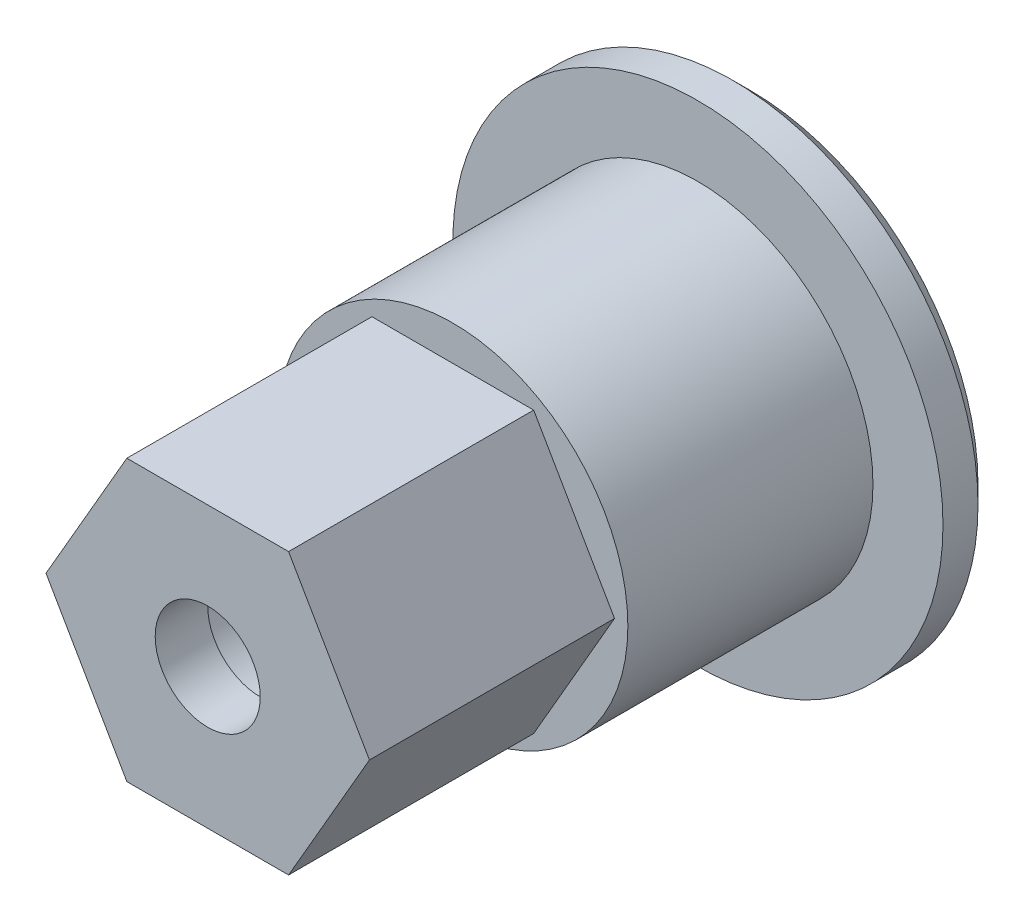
ISO-10303-21;
HEADER;
FILE_DESCRIPTION(('STEP AP214'),'2;1');
FILE_NAME('part.step','',(''),(''),'','','');
FILE_SCHEMA(('AUTOMOTIVE_DESIGN { 1 0 10303 214 1 1 1 1 }'));
ENDSEC;
DATA;
#1=APPLICATION_CONTEXT('core data for automotive mechanical design processes');
#2=APPLICATION_PROTOCOL_DEFINITION('international standard','automotive_design',2000,#1);
#3=PRODUCT_CONTEXT('',#1,'mechanical');
#4=PRODUCT('Part','Part','',(#3));
#5=PRODUCT_RELATED_PRODUCT_CATEGORY('part','',(#4));
#6=PRODUCT_DEFINITION_FORMATION('','',#4);
#7=PRODUCT_DEFINITION_CONTEXT('part definition',#1,'design');
#8=PRODUCT_DEFINITION('design','',#6,#7);
#9=PRODUCT_DEFINITION_SHAPE('','',#8);
#10=(LENGTH_UNIT() NAMED_UNIT(*) SI_UNIT(.MILLI.,.METRE.));
#11=(NAMED_UNIT(*) PLANE_ANGLE_UNIT() SI_UNIT($,.RADIAN.));
#12=(NAMED_UNIT(*) SI_UNIT($,.STERADIAN.) SOLID_ANGLE_UNIT());
#13=UNCERTAINTY_MEASURE_WITH_UNIT(LENGTH_MEASURE(1.E-05),#10,'distance_accuracy_value','');
#14=(GEOMETRIC_REPRESENTATION_CONTEXT(3) GLOBAL_UNCERTAINTY_ASSIGNED_CONTEXT((#13)) GLOBAL_UNIT_ASSIGNED_CONTEXT((#10,
#11,#12)) REPRESENTATION_CONTEXT('',''));
#15=CARTESIAN_POINT('',(0.,0.,0.));
#16=DIRECTION('',(0.,0.,1.));
#17=DIRECTION('',(1.,0.,0.));
#18=AXIS2_PLACEMENT_3D('',#15,#16,#17);
#19=CARTESIAN_POINT('',(0.,0.,31.));
#20=DIRECTION('',(0.,0.,-1.));
#21=DIRECTION('',(-1.,0.,0.));
#22=AXIS2_PLACEMENT_3D('',#19,#20,#21);
#23=CYLINDRICAL_SURFACE('',#22,3.);
#24=CARTESIAN_POINT('',(0.,0.,31.));
#25=DIRECTION('',(0.,0.,1.));
#26=DIRECTION('',(1.,0.,0.));
#27=AXIS2_PLACEMENT_3D('',#24,#25,#26);
#28=CIRCLE('',#27,3.);
#29=CARTESIAN_POINT('',(3.,0.,31.));
#30=VERTEX_POINT('',#29);
#31=EDGE_CURVE('E144',#30,#30,#28,.T.);
#32=ORIENTED_EDGE('',*,*,#31,.T.);
#33=EDGE_LOOP('',(#32));
#34=FACE_BOUND('',#33,.T.);
#35=CARTESIAN_POINT('',(0.,0.,28.));
#36=DIRECTION('',(0.,0.,-1.));
#37=DIRECTION('',(-1.,0.,0.));
#38=AXIS2_PLACEMENT_3D('',#35,#36,#37);
#39=CIRCLE('',#38,3.);
#40=CARTESIAN_POINT('',(-3.00000000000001,0.,28.));
#41=VERTEX_POINT('',#40);
#42=EDGE_CURVE('E152',#41,#41,#39,.T.);
#43=ORIENTED_EDGE('',*,*,#42,.T.);
#44=EDGE_LOOP('',(#43));
#45=FACE_BOUND('',#44,.T.);
#46=ADVANCED_FACE('F34',(#34,#45),#23,.F.);
#47=CARTESIAN_POINT('',(0.,0.,31.));
#48=DIRECTION('',(0.,0.,1.));
#49=DIRECTION('',(1.,0.,0.));
#50=AXIS2_PLACEMENT_3D('',#47,#48,#49);
#51=PLANE('',#50);
#52=ORIENTED_EDGE('',*,*,#31,.F.);
#53=EDGE_LOOP('',(#52));
#54=FACE_BOUND('',#53,.T.);
#55=DIRECTION('',(1.,0.,0.));
#56=VECTOR('',#55,1.);
#57=CARTESIAN_POINT('',(-4.61880215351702,-7.99999999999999,31.));
#58=LINE('',#57,#56);
#59=CARTESIAN_POINT('',(-4.61880215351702,-7.99999999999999,31.));
#60=VERTEX_POINT('',#59);
#61=CARTESIAN_POINT('',(4.61880215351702,-7.99999999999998,31.));
#62=VERTEX_POINT('',#61);
#63=EDGE_CURVE('E114',#60,#62,#58,.T.);
#64=ORIENTED_EDGE('',*,*,#63,.T.);
#65=DIRECTION('',(0.499999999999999,0.86602540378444,0.));
#66=VECTOR('',#65,1.);
#67=CARTESIAN_POINT('',(4.61880215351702,-7.99999999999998,31.));
#68=LINE('',#67,#66);
#69=CARTESIAN_POINT('',(9.23760430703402,0.,31.));
#70=VERTEX_POINT('',#69);
#71=EDGE_CURVE('E109',#62,#70,#68,.T.);
#72=ORIENTED_EDGE('',*,*,#71,.T.);
#73=DIRECTION('',(-0.500000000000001,0.866025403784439,0.));
#74=VECTOR('',#73,1.);
#75=CARTESIAN_POINT('',(9.23760430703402,0.,31.));
#76=LINE('',#75,#74);
#77=CARTESIAN_POINT('',(4.61880215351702,8.00000000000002,31.));
#78=VERTEX_POINT('',#77);
#79=EDGE_CURVE('E107',#70,#78,#76,.T.);
#80=ORIENTED_EDGE('',*,*,#79,.T.);
#81=DIRECTION('',(-1.,0.,0.));
#82=VECTOR('',#81,1.);
#83=CARTESIAN_POINT('',(4.61880215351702,8.00000000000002,31.));
#84=LINE('',#83,#82);
#85=CARTESIAN_POINT('',(-4.61880215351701,8.00000000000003,31.));
#86=VERTEX_POINT('',#85);
#87=EDGE_CURVE('E49',#78,#86,#84,.T.);
#88=ORIENTED_EDGE('',*,*,#87,.T.);
#89=DIRECTION('',(-0.500000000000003,-0.866025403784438,0.));
#90=VECTOR('',#89,1.);
#91=CARTESIAN_POINT('',(-4.61880215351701,8.00000000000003,31.));
#92=LINE('',#91,#90);
#93=CARTESIAN_POINT('',(-9.23760430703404,0.,31.));
#94=VERTEX_POINT('',#93);
#95=EDGE_CURVE('E95',#86,#94,#92,.T.);
#96=ORIENTED_EDGE('',*,*,#95,.T.);
#97=DIRECTION('',(0.500000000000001,-0.866025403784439,0.));
#98=VECTOR('',#97,1.);
#99=CARTESIAN_POINT('',(-9.23760430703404,0.,31.));
#100=LINE('',#99,#98);
#101=EDGE_CURVE('E100',#94,#60,#100,.T.);
#102=ORIENTED_EDGE('',*,*,#101,.T.);
#103=EDGE_LOOP('',(#64,#72,#80,#88,#96,#102));
#104=FACE_BOUND('',#103,.T.);
#105=ADVANCED_FACE('F104',(#54,#104),#51,.T.);
#106=CARTESIAN_POINT('',(0.,0.,3.));
#107=DIRECTION('',(0.,0.,1.));
#108=DIRECTION('',(1.,0.,0.));
#109=AXIS2_PLACEMENT_3D('',#106,#107,#108);
#110=CYLINDRICAL_SURFACE('',#109,10.);
#111=CARTESIAN_POINT('',(0.,0.,3.));
#112=DIRECTION('',(0.,0.,1.));
#113=DIRECTION('',(1.,0.,0.));
#114=AXIS2_PLACEMENT_3D('',#111,#112,#113);
#115=CIRCLE('',#114,10.);
#116=CARTESIAN_POINT('',(10.,0.,2.99999999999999));
#117=VERTEX_POINT('',#116);
#118=EDGE_CURVE('E140',#117,#117,#115,.T.);
#119=ORIENTED_EDGE('',*,*,#118,.T.);
#120=EDGE_LOOP('',(#119));
#121=FACE_BOUND('',#120,.T.);
#122=CARTESIAN_POINT('',(0.,0.,17.));
#123=DIRECTION('',(0.,0.,1.));
#124=DIRECTION('',(1.,0.,0.));
#125=AXIS2_PLACEMENT_3D('',#122,#123,#124);
#126=CIRCLE('',#125,10.);
#127=CARTESIAN_POINT('',(10.,0.,17.));
#128=VERTEX_POINT('',#127);
#129=EDGE_CURVE('E134',#128,#128,#126,.F.);
#130=ORIENTED_EDGE('',*,*,#129,.T.);
#131=EDGE_LOOP('',(#130));
#132=FACE_BOUND('',#131,.T.);
#133=ADVANCED_FACE('F176',(#121,#132),#110,.T.);
#134=CARTESIAN_POINT('',(0.,0.,31.));
#135=DIRECTION('',(0.,0.,-1.));
#136=DIRECTION('',(-1.,0.,0.));
#137=AXIS2_PLACEMENT_3D('',#134,#135,#136);
#138=CYLINDRICAL_SURFACE('',#137,14.);
#139=CARTESIAN_POINT('',(0.,0.,1.00000000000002));
#140=DIRECTION('',(0.,0.,1.));
#141=DIRECTION('',(1.,0.,0.));
#142=AXIS2_PLACEMENT_3D('',#139,#140,#141);
#143=CIRCLE('',#142,14.);
#144=CARTESIAN_POINT('',(14.,0.,1.00000000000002));
#145=VERTEX_POINT('',#144);
#146=EDGE_CURVE('E147',#145,#145,#143,.T.);
#147=ORIENTED_EDGE('',*,*,#146,.T.);
#148=EDGE_LOOP('',(#147));
#149=FACE_BOUND('',#148,.T.);
#150=CARTESIAN_POINT('',(0.,0.,3.));
#151=DIRECTION('',(0.,0.,1.));
#152=DIRECTION('',(1.,0.,0.));
#153=AXIS2_PLACEMENT_3D('',#150,#151,#152);
#154=CIRCLE('',#153,14.);
#155=CARTESIAN_POINT('',(14.,0.,2.99999999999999));
#156=VERTEX_POINT('',#155);
#157=EDGE_CURVE('E143',#156,#156,#154,.T.);
#158=ORIENTED_EDGE('',*,*,#157,.F.);
#159=EDGE_LOOP('',(#158));
#160=FACE_BOUND('',#159,.T.);
#161=ADVANCED_FACE('F36',(#149,#160),#138,.T.);
#162=CARTESIAN_POINT('',(0.,0.,0.));
#163=DIRECTION('',(0.,0.,1.));
#164=DIRECTION('',(1.,0.,0.));
#165=AXIS2_PLACEMENT_3D('',#162,#163,#164);
#166=PLANE('',#165);
#167=CARTESIAN_POINT('',(0.,0.,0.));
#168=DIRECTION('',(0.,0.,1.));
#169=DIRECTION('',(1.,0.,0.));
#170=AXIS2_PLACEMENT_3D('',#167,#168,#169);
#171=CIRCLE('',#170,13.);
#172=CARTESIAN_POINT('',(13.,0.,0.));
#173=VERTEX_POINT('',#172);
#174=EDGE_CURVE('E42',#173,#173,#171,.F.);
#175=ORIENTED_EDGE('',*,*,#174,.T.);
#176=EDGE_LOOP('',(#175));
#177=FACE_BOUND('',#176,.T.);
#178=CARTESIAN_POINT('',(0.,0.,0.));
#179=DIRECTION('',(0.,0.,1.));
#180=DIRECTION('',(1.,0.,0.));
#181=AXIS2_PLACEMENT_3D('',#178,#179,#180);
#182=CIRCLE('',#181,5.05000000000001);
#183=CARTESIAN_POINT('',(5.05000000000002,0.,0.));
#184=VERTEX_POINT('',#183);
#185=EDGE_CURVE('E158',#184,#184,#182,.T.);
#186=ORIENTED_EDGE('',*,*,#185,.T.);
#187=EDGE_LOOP('',(#186));
#188=FACE_BOUND('',#187,.T.);
#189=ADVANCED_FACE('F163',(#177,#188),#166,.F.);
#190=CARTESIAN_POINT('',(0.,0.,3.));
#191=DIRECTION('',(0.,0.,1.));
#192=DIRECTION('',(1.,0.,0.));
#193=AXIS2_PLACEMENT_3D('',#190,#191,#192);
#194=PLANE('',#193);
#195=ORIENTED_EDGE('',*,*,#118,.F.);
#196=EDGE_LOOP('',(#195));
#197=FACE_BOUND('',#196,.T.);
#198=ORIENTED_EDGE('',*,*,#157,.T.);
#199=EDGE_LOOP('',(#198));
#200=FACE_BOUND('',#199,.T.);
#201=ADVANCED_FACE('F179',(#197,#200),#194,.T.);
#202=CARTESIAN_POINT('',(0.,0.,17.));
#203=DIRECTION('',(0.,0.,1.));
#204=DIRECTION('',(1.,0.,0.));
#205=AXIS2_PLACEMENT_3D('',#202,#203,#204);
#206=PLANE('',#205);
#207=ORIENTED_EDGE('',*,*,#129,.F.);
#208=EDGE_LOOP('',(#207));
#209=FACE_BOUND('',#208,.T.);
#210=DIRECTION('',(1.,0.,0.));
#211=VECTOR('',#210,1.);
#212=CARTESIAN_POINT('',(-4.61880215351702,-8.,17.));
#213=LINE('',#212,#211);
#214=CARTESIAN_POINT('',(-4.61880215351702,-8.,17.));
#215=VERTEX_POINT('',#214);
#216=CARTESIAN_POINT('',(4.61880215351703,-7.99999999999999,17.));
#217=VERTEX_POINT('',#216);
#218=EDGE_CURVE('E128',#215,#217,#213,.T.);
#219=ORIENTED_EDGE('',*,*,#218,.F.);
#220=DIRECTION('',(0.500000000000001,-0.866025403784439,0.));
#221=VECTOR('',#220,1.);
#222=CARTESIAN_POINT('',(-9.23760430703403,0.,17.));
#223=LINE('',#222,#221);
#224=CARTESIAN_POINT('',(-9.23760430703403,0.,17.));
#225=VERTEX_POINT('',#224);
#226=EDGE_CURVE('E125',#225,#215,#223,.T.);
#227=ORIENTED_EDGE('',*,*,#226,.F.);
#228=DIRECTION('',(-0.500000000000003,-0.866025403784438,0.));
#229=VECTOR('',#228,1.);
#230=CARTESIAN_POINT('',(-4.61880215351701,8.00000000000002,17.));
#231=LINE('',#230,#229);
#232=CARTESIAN_POINT('',(-4.61880215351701,8.00000000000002,17.));
#233=VERTEX_POINT('',#232);
#234=EDGE_CURVE('E123',#233,#225,#231,.T.);
#235=ORIENTED_EDGE('',*,*,#234,.F.);
#236=DIRECTION('',(-1.,0.,0.));
#237=VECTOR('',#236,1.);
#238=CARTESIAN_POINT('',(4.61880215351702,8.00000000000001,17.));
#239=LINE('',#238,#237);
#240=CARTESIAN_POINT('',(4.61880215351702,8.00000000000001,17.));
#241=VERTEX_POINT('',#240);
#242=EDGE_CURVE('E57',#241,#233,#239,.T.);
#243=ORIENTED_EDGE('',*,*,#242,.F.);
#244=DIRECTION('',(-0.500000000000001,0.866025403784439,0.));
#245=VECTOR('',#244,1.);
#246=CARTESIAN_POINT('',(9.23760430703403,0.,17.));
#247=LINE('',#246,#245);
#248=CARTESIAN_POINT('',(9.23760430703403,0.,17.));
#249=VERTEX_POINT('',#248);
#250=EDGE_CURVE('E119',#249,#241,#247,.T.);
#251=ORIENTED_EDGE('',*,*,#250,.F.);
#252=DIRECTION('',(0.499999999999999,0.86602540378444,0.));
#253=VECTOR('',#252,1.);
#254=CARTESIAN_POINT('',(4.61880215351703,-7.99999999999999,17.));
#255=LINE('',#254,#253);
#256=EDGE_CURVE('E116',#217,#249,#255,.T.);
#257=ORIENTED_EDGE('',*,*,#256,.F.);
#258=EDGE_LOOP('',(#219,#227,#235,#243,#251,#257));
#259=FACE_BOUND('',#258,.T.);
#260=ADVANCED_FACE('F181',(#209,#259),#206,.T.);
#261=CARTESIAN_POINT('',(4.61880215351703,-7.99999999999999,17.));
#262=DIRECTION('',(0.866025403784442,-0.499999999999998,0.));
#263=DIRECTION('',(0.499999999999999,0.86602540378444,0.));
#264=AXIS2_PLACEMENT_3D('',#261,#262,#263);
#265=PLANE('',#264);
#266=ORIENTED_EDGE('',*,*,#71,.F.);
#267=DIRECTION('',(0.,0.,1.));
#268=VECTOR('',#267,1.);
#269=CARTESIAN_POINT('',(4.61880215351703,-7.99999999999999,17.));
#270=LINE('',#269,#268);
#271=EDGE_CURVE('E132',#217,#62,#270,.T.);
#272=ORIENTED_EDGE('',*,*,#271,.F.);
#273=ORIENTED_EDGE('',*,*,#256,.T.);
#274=DIRECTION('',(0.,0.,1.));
#275=VECTOR('',#274,1.);
#276=CARTESIAN_POINT('',(9.23760430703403,0.,17.));
#277=LINE('',#276,#275);
#278=EDGE_CURVE('E131',#249,#70,#277,.T.);
#279=ORIENTED_EDGE('',*,*,#278,.T.);
#280=EDGE_LOOP('',(#266,#272,#273,#279));
#281=FACE_BOUND('',#280,.T.);
#282=ADVANCED_FACE('F188',(#281),#265,.T.);
#283=CARTESIAN_POINT('',(-4.61880215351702,-8.,17.));
#284=DIRECTION('',(0.,-1.,0.));
#285=DIRECTION('',(0.,0.,-1.));
#286=AXIS2_PLACEMENT_3D('',#283,#284,#285);
#287=PLANE('',#286);
#288=ORIENTED_EDGE('',*,*,#63,.F.);
#289=DIRECTION('',(0.,0.,1.));
#290=VECTOR('',#289,1.);
#291=CARTESIAN_POINT('',(-4.61880215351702,-8.,17.));
#292=LINE('',#291,#290);
#293=EDGE_CURVE('E135',#215,#60,#292,.T.);
#294=ORIENTED_EDGE('',*,*,#293,.F.);
#295=ORIENTED_EDGE('',*,*,#218,.T.);
#296=ORIENTED_EDGE('',*,*,#271,.T.);
#297=EDGE_LOOP('',(#288,#294,#295,#296));
#298=FACE_BOUND('',#297,.T.);
#299=ADVANCED_FACE('F222',(#298),#287,.T.);
#300=CARTESIAN_POINT('',(-9.23760430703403,0.,17.));
#301=DIRECTION('',(-0.866025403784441,-0.500000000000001,0.));
#302=DIRECTION('',(0.500000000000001,-0.866025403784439,0.));
#303=AXIS2_PLACEMENT_3D('',#300,#301,#302);
#304=PLANE('',#303);
#305=ORIENTED_EDGE('',*,*,#101,.F.);
#306=DIRECTION('',(0.,0.,1.));
#307=VECTOR('',#306,1.);
#308=CARTESIAN_POINT('',(-9.23760430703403,0.,17.));
#309=LINE('',#308,#307);
#310=EDGE_CURVE('E91',#225,#94,#309,.T.);
#311=ORIENTED_EDGE('',*,*,#310,.F.);
#312=ORIENTED_EDGE('',*,*,#226,.T.);
#313=ORIENTED_EDGE('',*,*,#293,.T.);
#314=EDGE_LOOP('',(#305,#311,#312,#313));
#315=FACE_BOUND('',#314,.T.);
#316=ADVANCED_FACE('F224',(#315),#304,.T.);
#317=CARTESIAN_POINT('',(-4.61880215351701,8.00000000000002,17.));
#318=DIRECTION('',(-0.866025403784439,0.500000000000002,0.));
#319=DIRECTION('',(-0.500000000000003,-0.866025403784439,0.));
#320=AXIS2_PLACEMENT_3D('',#317,#318,#319);
#321=PLANE('',#320);
#322=ORIENTED_EDGE('',*,*,#95,.F.);
#323=DIRECTION('',(0.,0.,1.));
#324=VECTOR('',#323,1.);
#325=CARTESIAN_POINT('',(-4.61880215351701,8.00000000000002,17.));
#326=LINE('',#325,#324);
#327=EDGE_CURVE('E86',#233,#86,#326,.T.);
#328=ORIENTED_EDGE('',*,*,#327,.F.);
#329=ORIENTED_EDGE('',*,*,#234,.T.);
#330=ORIENTED_EDGE('',*,*,#310,.T.);
#331=EDGE_LOOP('',(#322,#328,#329,#330));
#332=FACE_BOUND('',#331,.T.);
#333=ADVANCED_FACE('F96',(#332),#321,.T.);
#334=CARTESIAN_POINT('',(4.61880215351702,8.00000000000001,17.));
#335=DIRECTION('',(0.,1.,0.));
#336=DIRECTION('',(0.,0.,1.));
#337=AXIS2_PLACEMENT_3D('',#334,#335,#336);
#338=PLANE('',#337);
#339=ORIENTED_EDGE('',*,*,#87,.F.);
#340=DIRECTION('',(0.,0.,1.));
#341=VECTOR('',#340,1.);
#342=CARTESIAN_POINT('',(4.61880215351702,8.00000000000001,17.));
#343=LINE('',#342,#341);
#344=EDGE_CURVE('E92',#241,#78,#343,.T.);
#345=ORIENTED_EDGE('',*,*,#344,.F.);
#346=ORIENTED_EDGE('',*,*,#242,.T.);
#347=ORIENTED_EDGE('',*,*,#327,.T.);
#348=EDGE_LOOP('',(#339,#345,#346,#347));
#349=FACE_BOUND('',#348,.T.);
#350=ADVANCED_FACE('F88',(#349),#338,.T.);
#351=CARTESIAN_POINT('',(9.23760430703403,0.,17.));
#352=DIRECTION('',(0.86602540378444,0.500000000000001,0.));
#353=DIRECTION('',(-0.500000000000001,0.866025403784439,0.));
#354=AXIS2_PLACEMENT_3D('',#351,#352,#353);
#355=PLANE('',#354);
#356=ORIENTED_EDGE('',*,*,#79,.F.);
#357=ORIENTED_EDGE('',*,*,#278,.F.);
#358=ORIENTED_EDGE('',*,*,#250,.T.);
#359=ORIENTED_EDGE('',*,*,#344,.T.);
#360=EDGE_LOOP('',(#356,#357,#358,#359));
#361=FACE_BOUND('',#360,.T.);
#362=ADVANCED_FACE('F218',(#361),#355,.T.);
#363=CARTESIAN_POINT('',(0.,0.,28.));
#364=DIRECTION('',(0.,0.,-1.));
#365=DIRECTION('',(-1.,0.,0.));
#366=AXIS2_PLACEMENT_3D('',#363,#364,#365);
#367=CYLINDRICAL_SURFACE('',#366,4.05);
#368=CARTESIAN_POINT('',(0.,0.,1.00000000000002));
#369=DIRECTION('',(0.,0.,1.));
#370=DIRECTION('',(1.,0.,0.));
#371=AXIS2_PLACEMENT_3D('',#368,#369,#370);
#372=CIRCLE('',#371,4.05);
#373=CARTESIAN_POINT('',(4.05000000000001,0.,1.00000000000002));
#374=VERTEX_POINT('',#373);
#375=EDGE_CURVE('E11',#374,#374,#372,.F.);
#376=ORIENTED_EDGE('',*,*,#375,.T.);
#377=EDGE_LOOP('',(#376));
#378=FACE_BOUND('',#377,.T.);
#379=CARTESIAN_POINT('',(0.,0.,28.));
#380=DIRECTION('',(0.,0.,-1.));
#381=DIRECTION('',(-1.,0.,0.));
#382=AXIS2_PLACEMENT_3D('',#379,#380,#381);
#383=CIRCLE('',#382,4.05);
#384=CARTESIAN_POINT('',(-4.05000000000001,0.,28.));
#385=VERTEX_POINT('',#384);
#386=EDGE_CURVE('E155',#385,#385,#383,.T.);
#387=ORIENTED_EDGE('',*,*,#386,.F.);
#388=EDGE_LOOP('',(#387));
#389=FACE_BOUND('',#388,.T.);
#390=ADVANCED_FACE('F207',(#378,#389),#367,.F.);
#391=CARTESIAN_POINT('',(0.,0.,28.));
#392=DIRECTION('',(0.,0.,-1.));
#393=DIRECTION('',(-1.,0.,0.));
#394=AXIS2_PLACEMENT_3D('',#391,#392,#393);
#395=PLANE('',#394);
#396=ORIENTED_EDGE('',*,*,#42,.F.);
#397=EDGE_LOOP('',(#396));
#398=FACE_BOUND('',#397,.T.);
#399=ORIENTED_EDGE('',*,*,#386,.T.);
#400=EDGE_LOOP('',(#399));
#401=FACE_BOUND('',#400,.T.);
#402=ADVANCED_FACE('F170',(#398,#401),#395,.T.);
#403=CARTESIAN_POINT('',(0.,0.,1.00000000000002));
#404=DIRECTION('',(0.,0.,1.));
#405=DIRECTION('',(1.,0.,0.));
#406=AXIS2_PLACEMENT_3D('',#403,#404,#405);
#407=CONICAL_SURFACE('',#406,14.,0.785398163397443);
#408=ORIENTED_EDGE('',*,*,#174,.F.);
#409=EDGE_LOOP('',(#408));
#410=FACE_BOUND('',#409,.T.);
#411=ORIENTED_EDGE('',*,*,#146,.F.);
#412=EDGE_LOOP('',(#411));
#413=FACE_BOUND('',#412,.T.);
#414=ADVANCED_FACE('F166',(#410,#413),#407,.T.);
#415=CARTESIAN_POINT('',(0.,0.,1.00000000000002));
#416=DIRECTION('',(0.,0.,-1.));
#417=DIRECTION('',(-1.,0.,0.));
#418=AXIS2_PLACEMENT_3D('',#415,#416,#417);
#419=CONICAL_SURFACE('',#418,4.05,0.785398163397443);
#420=ORIENTED_EDGE('',*,*,#185,.F.);
#421=EDGE_LOOP('',(#420));
#422=FACE_BOUND('',#421,.T.);
#423=ORIENTED_EDGE('',*,*,#375,.F.);
#424=EDGE_LOOP('',(#423));
#425=FACE_BOUND('',#424,.T.);
#426=ADVANCED_FACE('F169',(#422,#425),#419,.F.);
#427=CLOSED_SHELL('',(#46,#105,#133,#161,#189,#201,#260,#282,#299,#316,#333,#350,#362,#390,#402,
#414,#426));
#428=MANIFOLD_SOLID_BREP('B2',#427);
#429=ADVANCED_BREP_SHAPE_REPRESENTATION('',(#18,#428),#14);
#430=SHAPE_DEFINITION_REPRESENTATION(#9,#429);
ENDSEC;
END-ISO-10303-21;
